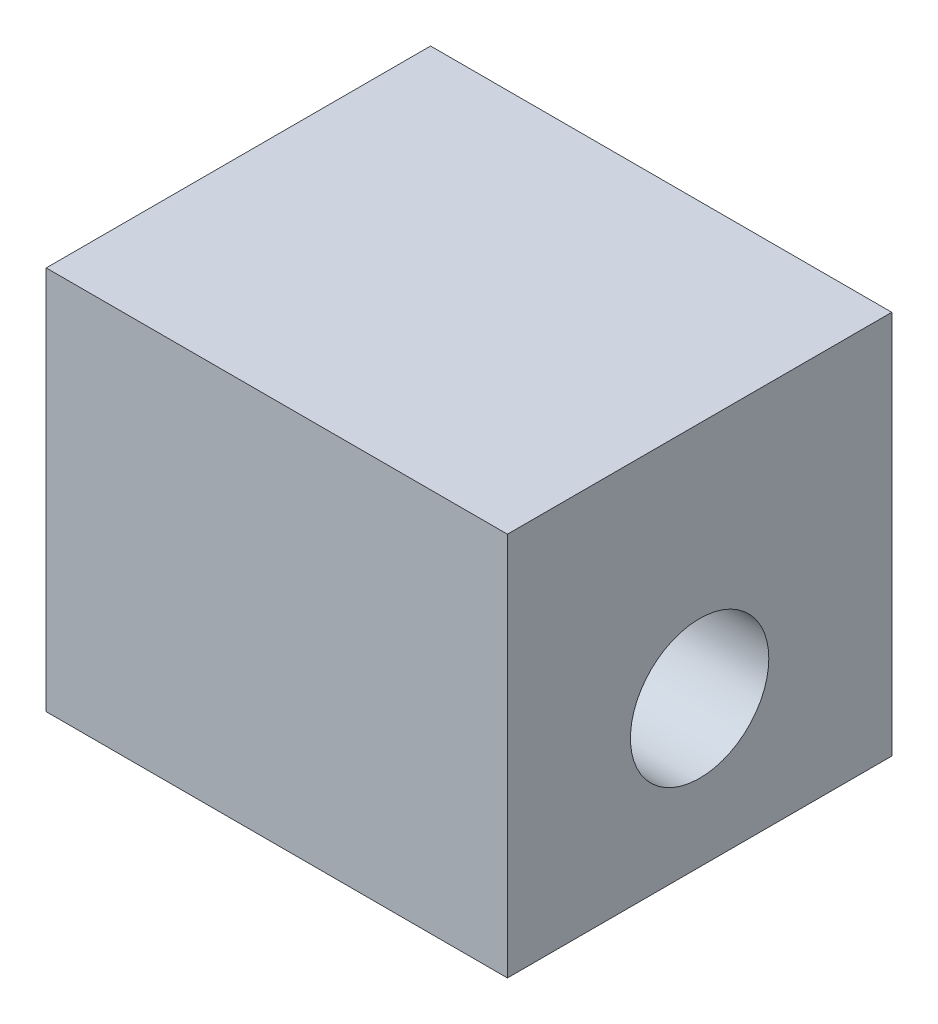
from build123d import *

# Parameters (mm, degrees)
SKETCH_1_W          = 12
SKETCH_1_H          = 10
EXTRUDE_1_DEPTH     = 10
SKETCH_2_R          = 1.8
CUT_EXTRUDE_1_DEPTH = 18.196702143


with BuildPart() as part:
    # Sketch 1 → Extrude 1 (new body)
    with BuildSketch(Plane(origin=(0, 0, 0), x_dir=(1, 0, 0), z_dir=(0, 1, 0))):
        with Locations((-12.02955665, -2.192118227)):
            Rectangle(SKETCH_1_W, SKETCH_1_H)
    extrude(amount=EXTRUDE_1_DEPTH)

    # Sketch 2 → Cut-Extrude 1 (cut, through all)
    with BuildSketch(Plane(origin=(-6.02955665, 0, 0), x_dir=(0, 0, -1), z_dir=(1, 0, 0))):
        with Locations((-2.192118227, 3.8)):
            Circle(SKETCH_2_R)
    extrude(amount=-CUT_EXTRUDE_1_DEPTH, mode=Mode.SUBTRACT)


solid = part.part
